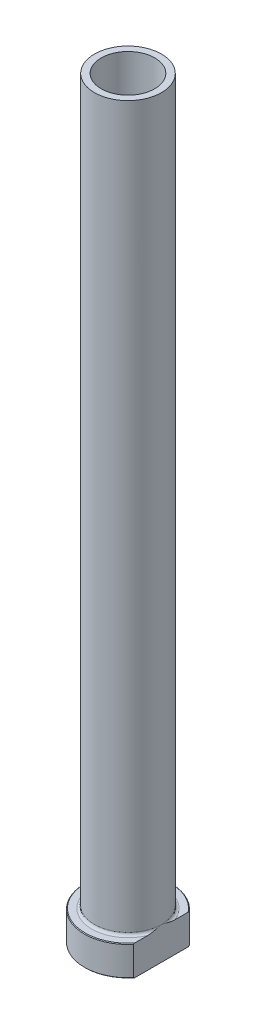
from build123d import *

# Parameters (mm, degrees)
FILLET1_R          = 0.8
CHAMFER1_SIZE      = 0.2
CUT_EXTRUDE1_DEPTH = 226.749861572
CHAMFER2_SIZE      = 0.5


with BuildPart() as part:
    # Sketch1 → Revolve1 (revolve)
    with BuildSketch(Plane.XY, mode=Mode.PRIVATE) as revolve1_sk:
        Polygon((-8, 225), (-10, 225), (-10, 9), (-13, 9), (-13, 0), (-8.25, 0), (-8.25, 158), (-8, 170), align=None)
    revolve(revolve1_sk.sketch.rotate(Axis((0, 92.187680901, 0), (0, -1, 0)), 270), axis=Axis((0, 92.187680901, 0), (0, -1, 0)))

    # Fillet1
    fillet1_edges = [part.edges().sort_by_distance(p)[0] for p in [
        (0, 9, -10),
    ]]
    fillet(fillet1_edges, radius=FILLET1_R)

    # Chamfer1
    chamfer1_edges = [part.edges().sort_by_distance(p)[0] for p in [
        (0, 0, -13),
        (0, 9, -13),
    ]]
    chamfer(chamfer1_edges, length=CHAMFER1_SIZE)

    # Sketch2 → Cut-Extrude1 (cut, through all)
    with BuildSketch(Plane.XZ):
        with BuildLine():
            Line((10, 8.306623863), (10, -8.306623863))
            ThreePointArc((10, -8.306623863), (13, 0), (10, 8.306623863))
        make_face()
    extrude(amount=-CUT_EXTRUDE1_DEPTH, mode=Mode.SUBTRACT)

    # Chamfer2
    chamfer2_edges = [part.edges().sort_by_distance(p)[0] for p in [
        (0, 0, -8.25),
    ]]
    chamfer(chamfer2_edges, length=CHAMFER2_SIZE)


solid = part.part
